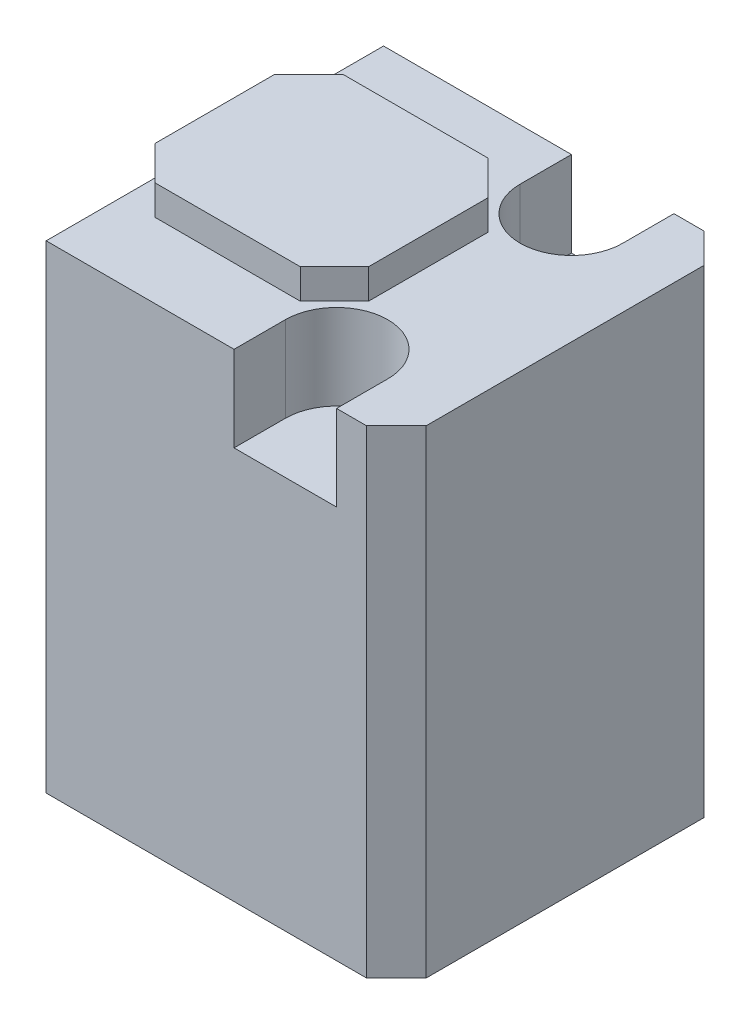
from build123d import *

# Parameters (mm, degrees)
SKETCH1_W          = 10.414
SKETCH1_H          = 10.033
EXTRUDE1_DEPTH     = 14.224
CHAMFER1_SIZE      = 0.889
CUT_EXTRUDE1_DEPTH = 2.54
EXTRUDE2_DEPTH     = 0.889


with BuildPart() as part:
    # Sketch1 → Extrude1 (new body)
    with BuildSketch(Plane(origin=(0, 0, 0), x_dir=(1, 0, 0), z_dir=(0, 1, 0))):
        with Locations((5.207, 5.0165)):
            Rectangle(SKETCH1_W, SKETCH1_H)
    extrude(amount=EXTRUDE1_DEPTH)

    # Chamfer1
    chamfer1_edges = [part.edges().sort_by_distance(p)[0] for p in [
        (10.414, 7.112, -10.033),
        (10.414, 7.112, 0),
    ]]
    chamfer(chamfer1_edges, length=CHAMFER1_SIZE)

    # Sketch2 → Cut-Extrude1 (cut)
    with BuildSketch(Plane(origin=(0, 14.224, 0), x_dir=(-1, 0, 0), z_dir=(0, 1, 0))):
        with BuildLine():
            Line((-5.588, 0), (-8.636, 0))
            Line((-8.636, 0), (-8.636, -1.524))
            ThreePointArc((-8.636, -1.524), (-7.112, -3.048), (-5.588, -1.524))
            Line((-5.588, -1.524), (-5.588, 0))
        make_face()
    cut_extrude1 = extrude(amount=-CUT_EXTRUDE1_DEPTH, mode=Mode.SUBTRACT)

    # Mirror1: Cut-Extrude1 across plane
    add(cut_extrude1.mirror(Plane.XY.offset(-5.0165)), mode=Mode.SUBTRACT)

    # Sketch3 → Extrude2 (add)
    with BuildSketch(Plane(origin=(0, 14.224, 0), x_dir=(-1, 0, 0), z_dir=(0, 1, 0))):
        Polygon((-1.016, -2.2225), (-5.334, -2.2225), (-6.35, -3.2385), (-6.35, -6.7945), (-5.334, -7.8105), (-1.016, -7.8105), (0, -6.7945), (0, -3.2385), align=None)
    extrude(amount=EXTRUDE2_DEPTH)


solid = part.part
